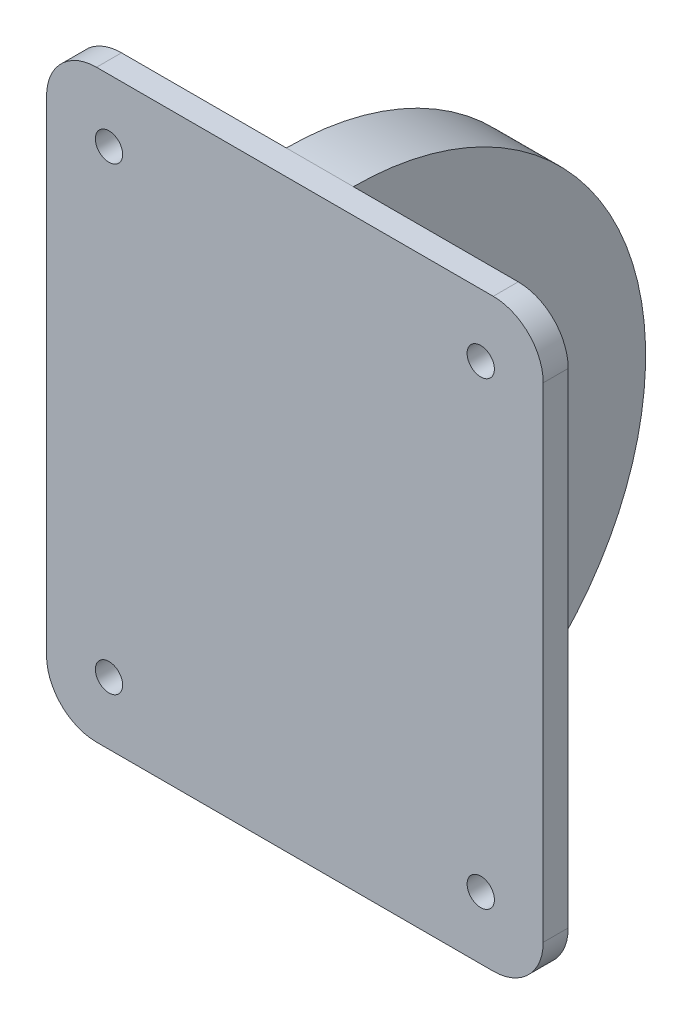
ISO-10303-21;
HEADER;
FILE_DESCRIPTION(('STEP AP214'),'2;1');
FILE_NAME('part.step','',(''),(''),'','','');
FILE_SCHEMA(('AUTOMOTIVE_DESIGN { 1 0 10303 214 1 1 1 1 }'));
ENDSEC;
DATA;
#1=APPLICATION_CONTEXT('core data for automotive mechanical design processes');
#2=APPLICATION_PROTOCOL_DEFINITION('international standard','automotive_design',2000,#1);
#3=PRODUCT_CONTEXT('',#1,'mechanical');
#4=PRODUCT('Part','Part','',(#3));
#5=PRODUCT_RELATED_PRODUCT_CATEGORY('part','',(#4));
#6=PRODUCT_DEFINITION_FORMATION('','',#4);
#7=PRODUCT_DEFINITION_CONTEXT('part definition',#1,'design');
#8=PRODUCT_DEFINITION('design','',#6,#7);
#9=PRODUCT_DEFINITION_SHAPE('','',#8);
#10=(LENGTH_UNIT() NAMED_UNIT(*) SI_UNIT(.MILLI.,.METRE.));
#11=(NAMED_UNIT(*) PLANE_ANGLE_UNIT() SI_UNIT($,.RADIAN.));
#12=(NAMED_UNIT(*) SI_UNIT($,.STERADIAN.) SOLID_ANGLE_UNIT());
#13=UNCERTAINTY_MEASURE_WITH_UNIT(LENGTH_MEASURE(1.E-05),#10,'distance_accuracy_value','');
#14=(GEOMETRIC_REPRESENTATION_CONTEXT(3) GLOBAL_UNCERTAINTY_ASSIGNED_CONTEXT((#13)) GLOBAL_UNIT_ASSIGNED_CONTEXT((#10,
#11,#12)) REPRESENTATION_CONTEXT('',''));
#15=CARTESIAN_POINT('',(0.,0.,0.));
#16=DIRECTION('',(0.,0.,1.));
#17=DIRECTION('',(1.,0.,0.));
#18=AXIS2_PLACEMENT_3D('',#15,#16,#17);
#19=CARTESIAN_POINT('',(0.,0.,0.));
#20=DIRECTION('',(0.,0.,1.));
#21=DIRECTION('',(1.,0.,0.));
#22=AXIS2_PLACEMENT_3D('',#19,#20,#21);
#23=PLANE('',#22);
#24=CARTESIAN_POINT('',(-14.8758680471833,18.3896666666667,0.));
#25=DIRECTION('',(0.,0.,1.));
#26=DIRECTION('',(1.,0.,0.));
#27=AXIS2_PLACEMENT_3D('',#24,#25,#26);
#28=CIRCLE('',#27,1.0922);
#29=CARTESIAN_POINT('',(-13.7836680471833,18.3896666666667,0.));
#30=VERTEX_POINT('',#29);
#31=EDGE_CURVE('E174',#30,#30,#28,.T.);
#32=ORIENTED_EDGE('',*,*,#31,.T.);
#33=EDGE_LOOP('',(#32));
#34=FACE_BOUND('',#33,.T.);
#35=CARTESIAN_POINT('',(-14.8758680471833,-18.3896666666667,0.));
#36=DIRECTION('',(0.,0.,1.));
#37=DIRECTION('',(1.,0.,0.));
#38=AXIS2_PLACEMENT_3D('',#35,#36,#37);
#39=CIRCLE('',#38,1.0922);
#40=CARTESIAN_POINT('',(-13.7836680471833,-18.3896666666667,0.));
#41=VERTEX_POINT('',#40);
#42=EDGE_CURVE('E159',#41,#41,#39,.T.);
#43=ORIENTED_EDGE('',*,*,#42,.T.);
#44=EDGE_LOOP('',(#43));
#45=FACE_BOUND('',#44,.T.);
#46=DIRECTION('',(0.,-1.,0.));
#47=VECTOR('',#46,1.);
#48=CARTESIAN_POINT('',(-2.68333333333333,23.3896666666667,0.));
#49=LINE('',#48,#47);
#50=CARTESIAN_POINT('',(-2.68333333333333,23.3896666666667,0.));
#51=VERTEX_POINT('',#50);
#52=CARTESIAN_POINT('',(-2.68333333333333,-23.3896666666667,0.));
#53=VERTEX_POINT('',#52);
#54=EDGE_CURVE('E132',#51,#53,#49,.T.);
#55=ORIENTED_EDGE('',*,*,#54,.T.);
#56=DIRECTION('',(1.,0.,0.));
#57=VECTOR('',#56,1.);
#58=CARTESIAN_POINT('',(-19.8758680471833,-23.3896666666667,0.));
#59=LINE('',#58,#57);
#60=CARTESIAN_POINT('',(-15.8758680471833,-23.3896666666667,0.));
#61=VERTEX_POINT('',#60);
#62=EDGE_CURVE('E183',#61,#53,#59,.T.);
#63=ORIENTED_EDGE('',*,*,#62,.F.);
#64=CARTESIAN_POINT('',(-15.8758680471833,-19.3896666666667,0.));
#65=DIRECTION('',(0.,0.,1.));
#66=DIRECTION('',(1.,0.,0.));
#67=AXIS2_PLACEMENT_3D('',#64,#65,#66);
#68=CIRCLE('',#67,4.);
#69=CARTESIAN_POINT('',(-19.8758680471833,-19.3896666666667,0.));
#70=VERTEX_POINT('',#69);
#71=EDGE_CURVE('E208',#61,#70,#68,.F.);
#72=ORIENTED_EDGE('',*,*,#71,.T.);
#73=DIRECTION('',(0.,-1.,0.));
#74=VECTOR('',#73,1.);
#75=CARTESIAN_POINT('',(-19.8758680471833,23.3896666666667,0.));
#76=LINE('',#75,#74);
#77=CARTESIAN_POINT('',(-19.8758680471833,19.3896666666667,0.));
#78=VERTEX_POINT('',#77);
#79=EDGE_CURVE('E195',#78,#70,#76,.T.);
#80=ORIENTED_EDGE('',*,*,#79,.F.);
#81=CARTESIAN_POINT('',(-15.8758680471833,19.3896666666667,0.));
#82=DIRECTION('',(0.,0.,1.));
#83=DIRECTION('',(1.,0.,0.));
#84=AXIS2_PLACEMENT_3D('',#81,#82,#83);
#85=CIRCLE('',#84,4.);
#86=CARTESIAN_POINT('',(-15.8758680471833,23.3896666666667,0.));
#87=VERTEX_POINT('',#86);
#88=EDGE_CURVE('E135',#78,#87,#85,.F.);
#89=ORIENTED_EDGE('',*,*,#88,.T.);
#90=DIRECTION('',(-1.,0.,0.));
#91=VECTOR('',#90,1.);
#92=CARTESIAN_POINT('',(-19.8758680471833,23.3896666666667,0.));
#93=LINE('',#92,#91);
#94=EDGE_CURVE('E118',#51,#87,#93,.T.);
#95=ORIENTED_EDGE('',*,*,#94,.F.);
#96=EDGE_LOOP('',(#55,#63,#72,#80,#89,#95));
#97=FACE_BOUND('',#96,.T.);
#98=ADVANCED_FACE('F40',(#34,#45,#97),#23,.F.);
#99=CARTESIAN_POINT('',(19.8758680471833,23.3896666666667,2.));
#100=DIRECTION('',(-1.,0.,0.));
#101=DIRECTION('',(0.,-1.,0.));
#102=AXIS2_PLACEMENT_3D('',#99,#100,#101);
#103=PLANE('',#102);
#104=DIRECTION('',(0.,1.,0.));
#105=VECTOR('',#104,1.);
#106=CARTESIAN_POINT('',(19.8758680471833,23.3896666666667,2.));
#107=LINE('',#106,#105);
#108=CARTESIAN_POINT('',(19.8758680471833,-19.3896666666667,2.));
#109=VERTEX_POINT('',#108);
#110=CARTESIAN_POINT('',(19.8758680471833,19.3896666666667,2.));
#111=VERTEX_POINT('',#110);
#112=EDGE_CURVE('E179',#109,#111,#107,.T.);
#113=ORIENTED_EDGE('',*,*,#112,.F.);
#114=DIRECTION('',(0.,0.,-1.));
#115=VECTOR('',#114,1.);
#116=CARTESIAN_POINT('',(19.8758680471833,-19.3896666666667,2.));
#117=LINE('',#116,#115);
#118=CARTESIAN_POINT('',(19.8758680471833,-19.3896666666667,0.));
#119=VERTEX_POINT('',#118);
#120=EDGE_CURVE('E225',#109,#119,#117,.T.);
#121=ORIENTED_EDGE('',*,*,#120,.T.);
#122=DIRECTION('',(0.,1.,0.));
#123=VECTOR('',#122,1.);
#124=CARTESIAN_POINT('',(19.8758680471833,23.3896666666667,0.));
#125=LINE('',#124,#123);
#126=CARTESIAN_POINT('',(19.8758680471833,19.3896666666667,0.));
#127=VERTEX_POINT('',#126);
#128=EDGE_CURVE('E137',#119,#127,#125,.T.);
#129=ORIENTED_EDGE('',*,*,#128,.T.);
#130=DIRECTION('',(0.,0.,-1.));
#131=VECTOR('',#130,1.);
#132=CARTESIAN_POINT('',(19.8758680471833,19.3896666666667,2.));
#133=LINE('',#132,#131);
#134=EDGE_CURVE('E223',#127,#111,#133,.F.);
#135=ORIENTED_EDGE('',*,*,#134,.T.);
#136=EDGE_LOOP('',(#113,#121,#129,#135));
#137=FACE_BOUND('',#136,.T.);
#138=ADVANCED_FACE('F236',(#137),#103,.F.);
#139=CARTESIAN_POINT('',(-19.8758680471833,23.3896666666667,2.));
#140=DIRECTION('',(0.,-1.,0.));
#141=DIRECTION('',(0.,0.,-1.));
#142=AXIS2_PLACEMENT_3D('',#139,#140,#141);
#143=PLANE('',#142);
#144=CARTESIAN_POINT('',(15.8758680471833,23.3896666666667,0.));
#145=VERTEX_POINT('',#144);
#146=CARTESIAN_POINT('',(2.68333333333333,23.3896666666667,0.));
#147=VERTEX_POINT('',#146);
#148=EDGE_CURVE('E121',#145,#147,#93,.T.);
#149=ORIENTED_EDGE('',*,*,#148,.T.);
#150=DIRECTION('',(-1.,0.,0.));
#151=VECTOR('',#150,1.);
#152=CARTESIAN_POINT('',(2.68333333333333,23.3896666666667,0.));
#153=LINE('',#152,#151);
#154=EDGE_CURVE('E115',#147,#51,#153,.T.);
#155=ORIENTED_EDGE('',*,*,#154,.T.);
#156=ORIENTED_EDGE('',*,*,#94,.T.);
#157=DIRECTION('',(0.,0.,-1.));
#158=VECTOR('',#157,1.);
#159=CARTESIAN_POINT('',(-15.8758680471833,23.3896666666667,2.));
#160=LINE('',#159,#158);
#161=CARTESIAN_POINT('',(-15.8758680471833,23.3896666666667,2.));
#162=VERTEX_POINT('',#161);
#163=EDGE_CURVE('E11',#87,#162,#160,.F.);
#164=ORIENTED_EDGE('',*,*,#163,.T.);
#165=DIRECTION('',(-1.,0.,0.));
#166=VECTOR('',#165,1.);
#167=CARTESIAN_POINT('',(-19.8758680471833,23.3896666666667,2.));
#168=LINE('',#167,#166);
#169=CARTESIAN_POINT('',(15.8758680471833,23.3896666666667,2.));
#170=VERTEX_POINT('',#169);
#171=EDGE_CURVE('E182',#170,#162,#168,.T.);
#172=ORIENTED_EDGE('',*,*,#171,.F.);
#173=DIRECTION('',(0.,0.,-1.));
#174=VECTOR('',#173,1.);
#175=CARTESIAN_POINT('',(15.8758680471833,23.3896666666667,2.));
#176=LINE('',#175,#174);
#177=EDGE_CURVE('E48',#170,#145,#176,.T.);
#178=ORIENTED_EDGE('',*,*,#177,.T.);
#179=EDGE_LOOP('',(#149,#155,#156,#164,#172,#178));
#180=FACE_BOUND('',#179,.T.);
#181=ADVANCED_FACE('F117',(#180),#143,.F.);
#182=CARTESIAN_POINT('',(-19.8758680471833,23.3896666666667,2.));
#183=DIRECTION('',(1.,0.,0.));
#184=DIRECTION('',(0.,1.,0.));
#185=AXIS2_PLACEMENT_3D('',#182,#183,#184);
#186=PLANE('',#185);
#187=ORIENTED_EDGE('',*,*,#79,.T.);
#188=DIRECTION('',(0.,0.,-1.));
#189=VECTOR('',#188,1.);
#190=CARTESIAN_POINT('',(-19.8758680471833,-19.3896666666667,2.));
#191=LINE('',#190,#189);
#192=CARTESIAN_POINT('',(-19.8758680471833,-19.3896666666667,2.));
#193=VERTEX_POINT('',#192);
#194=EDGE_CURVE('E213',#70,#193,#191,.F.);
#195=ORIENTED_EDGE('',*,*,#194,.T.);
#196=DIRECTION('',(0.,-1.,0.));
#197=VECTOR('',#196,1.);
#198=CARTESIAN_POINT('',(-19.8758680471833,23.3896666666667,2.));
#199=LINE('',#198,#197);
#200=CARTESIAN_POINT('',(-19.8758680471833,19.3896666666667,2.));
#201=VERTEX_POINT('',#200);
#202=EDGE_CURVE('E186',#201,#193,#199,.T.);
#203=ORIENTED_EDGE('',*,*,#202,.F.);
#204=DIRECTION('',(0.,0.,-1.));
#205=VECTOR('',#204,1.);
#206=CARTESIAN_POINT('',(-19.8758680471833,19.3896666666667,2.));
#207=LINE('',#206,#205);
#208=EDGE_CURVE('E210',#201,#78,#207,.T.);
#209=ORIENTED_EDGE('',*,*,#208,.T.);
#210=EDGE_LOOP('',(#187,#195,#203,#209));
#211=FACE_BOUND('',#210,.T.);
#212=ADVANCED_FACE('F255',(#211),#186,.F.);
#213=CARTESIAN_POINT('',(-19.8758680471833,-23.3896666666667,2.));
#214=DIRECTION('',(0.,1.,0.));
#215=DIRECTION('',(0.,0.,1.));
#216=AXIS2_PLACEMENT_3D('',#213,#214,#215);
#217=PLANE('',#216);
#218=DIRECTION('',(1.,0.,0.));
#219=VECTOR('',#218,1.);
#220=CARTESIAN_POINT('',(-19.8758680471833,-23.3896666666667,2.));
#221=LINE('',#220,#219);
#222=CARTESIAN_POINT('',(-15.8758680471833,-23.3896666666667,2.));
#223=VERTEX_POINT('',#222);
#224=CARTESIAN_POINT('',(15.8758680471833,-23.3896666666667,2.));
#225=VERTEX_POINT('',#224);
#226=EDGE_CURVE('E189',#223,#225,#221,.T.);
#227=ORIENTED_EDGE('',*,*,#226,.F.);
#228=DIRECTION('',(0.,0.,-1.));
#229=VECTOR('',#228,1.);
#230=CARTESIAN_POINT('',(-15.8758680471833,-23.3896666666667,2.));
#231=LINE('',#230,#229);
#232=EDGE_CURVE('E200',#223,#61,#231,.T.);
#233=ORIENTED_EDGE('',*,*,#232,.T.);
#234=ORIENTED_EDGE('',*,*,#62,.T.);
#235=DIRECTION('',(-1.,0.,0.));
#236=VECTOR('',#235,1.);
#237=CARTESIAN_POINT('',(2.68333333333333,-23.3896666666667,0.));
#238=LINE('',#237,#236);
#239=CARTESIAN_POINT('',(2.68333333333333,-23.3896666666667,0.));
#240=VERTEX_POINT('',#239);
#241=EDGE_CURVE('E127',#240,#53,#238,.T.);
#242=ORIENTED_EDGE('',*,*,#241,.F.);
#243=CARTESIAN_POINT('',(15.8758680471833,-23.3896666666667,0.));
#244=VERTEX_POINT('',#243);
#245=EDGE_CURVE('E60',#240,#244,#59,.T.);
#246=ORIENTED_EDGE('',*,*,#245,.T.);
#247=DIRECTION('',(0.,0.,-1.));
#248=VECTOR('',#247,1.);
#249=CARTESIAN_POINT('',(15.8758680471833,-23.3896666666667,2.));
#250=LINE('',#249,#248);
#251=EDGE_CURVE('E192',#244,#225,#250,.F.);
#252=ORIENTED_EDGE('',*,*,#251,.T.);
#253=EDGE_LOOP('',(#227,#233,#234,#242,#246,#252));
#254=FACE_BOUND('',#253,.T.);
#255=ADVANCED_FACE('F247',(#254),#217,.F.);
#256=CARTESIAN_POINT('',(0.,0.,2.));
#257=DIRECTION('',(0.,0.,1.));
#258=DIRECTION('',(1.,0.,0.));
#259=AXIS2_PLACEMENT_3D('',#256,#257,#258);
#260=PLANE('',#259);
#261=CARTESIAN_POINT('',(14.8758680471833,18.3896666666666,2.));
#262=DIRECTION('',(0.,0.,1.));
#263=DIRECTION('',(1.,0.,0.));
#264=AXIS2_PLACEMENT_3D('',#261,#262,#263);
#265=CIRCLE('',#264,1.0922);
#266=CARTESIAN_POINT('',(15.9680680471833,18.3896666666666,2.));
#267=VERTEX_POINT('',#266);
#268=EDGE_CURVE('E162',#267,#267,#265,.T.);
#269=ORIENTED_EDGE('',*,*,#268,.F.);
#270=EDGE_LOOP('',(#269));
#271=FACE_BOUND('',#270,.T.);
#272=CARTESIAN_POINT('',(-14.8758680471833,-18.3896666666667,2.));
#273=DIRECTION('',(0.,0.,1.));
#274=DIRECTION('',(1.,0.,0.));
#275=AXIS2_PLACEMENT_3D('',#272,#273,#274);
#276=CIRCLE('',#275,1.0922);
#277=CARTESIAN_POINT('',(-13.7836680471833,-18.3896666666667,2.));
#278=VERTEX_POINT('',#277);
#279=EDGE_CURVE('E169',#278,#278,#276,.T.);
#280=ORIENTED_EDGE('',*,*,#279,.F.);
#281=EDGE_LOOP('',(#280));
#282=FACE_BOUND('',#281,.T.);
#283=CARTESIAN_POINT('',(14.8758680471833,-18.3896666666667,2.));
#284=DIRECTION('',(0.,0.,1.));
#285=DIRECTION('',(1.,0.,0.));
#286=AXIS2_PLACEMENT_3D('',#283,#284,#285);
#287=CIRCLE('',#286,1.0922);
#288=CARTESIAN_POINT('',(15.9680680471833,-18.3896666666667,2.));
#289=VERTEX_POINT('',#288);
#290=EDGE_CURVE('E156',#289,#289,#287,.T.);
#291=ORIENTED_EDGE('',*,*,#290,.F.);
#292=EDGE_LOOP('',(#291));
#293=FACE_BOUND('',#292,.T.);
#294=CARTESIAN_POINT('',(-14.8758680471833,18.3896666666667,2.));
#295=DIRECTION('',(0.,0.,1.));
#296=DIRECTION('',(1.,0.,0.));
#297=AXIS2_PLACEMENT_3D('',#294,#295,#296);
#298=CIRCLE('',#297,1.0922);
#299=CARTESIAN_POINT('',(-13.7836680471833,18.3896666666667,2.));
#300=VERTEX_POINT('',#299);
#301=EDGE_CURVE('E165',#300,#300,#298,.T.);
#302=ORIENTED_EDGE('',*,*,#301,.F.);
#303=EDGE_LOOP('',(#302));
#304=FACE_BOUND('',#303,.T.);
#305=ORIENTED_EDGE('',*,*,#202,.T.);
#306=CARTESIAN_POINT('',(-15.8758680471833,-19.3896666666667,2.));
#307=DIRECTION('',(0.,0.,1.));
#308=DIRECTION('',(1.,0.,0.));
#309=AXIS2_PLACEMENT_3D('',#306,#307,#308);
#310=CIRCLE('',#309,4.);
#311=EDGE_CURVE('E221',#193,#223,#310,.T.);
#312=ORIENTED_EDGE('',*,*,#311,.T.);
#313=ORIENTED_EDGE('',*,*,#226,.T.);
#314=CARTESIAN_POINT('',(15.8758680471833,-19.3896666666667,2.));
#315=DIRECTION('',(0.,0.,1.));
#316=DIRECTION('',(1.,0.,0.));
#317=AXIS2_PLACEMENT_3D('',#314,#315,#316);
#318=CIRCLE('',#317,4.);
#319=EDGE_CURVE('E219',#225,#109,#318,.T.);
#320=ORIENTED_EDGE('',*,*,#319,.T.);
#321=ORIENTED_EDGE('',*,*,#112,.T.);
#322=CARTESIAN_POINT('',(15.8758680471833,19.3896666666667,2.));
#323=DIRECTION('',(0.,0.,1.));
#324=DIRECTION('',(1.,0.,0.));
#325=AXIS2_PLACEMENT_3D('',#322,#323,#324);
#326=CIRCLE('',#325,4.);
#327=EDGE_CURVE('E215',#111,#170,#326,.T.);
#328=ORIENTED_EDGE('',*,*,#327,.T.);
#329=ORIENTED_EDGE('',*,*,#171,.T.);
#330=CARTESIAN_POINT('',(-15.8758680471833,19.3896666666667,2.));
#331=DIRECTION('',(0.,0.,1.));
#332=DIRECTION('',(1.,0.,0.));
#333=AXIS2_PLACEMENT_3D('',#330,#331,#332);
#334=CIRCLE('',#333,4.);
#335=EDGE_CURVE('E217',#162,#201,#334,.T.);
#336=ORIENTED_EDGE('',*,*,#335,.T.);
#337=EDGE_LOOP('',(#305,#312,#313,#320,#321,#328,#329,#336));
#338=FACE_BOUND('',#337,.T.);
#339=ADVANCED_FACE('F239',(#271,#282,#293,#304,#338),#260,.T.);
#340=CARTESIAN_POINT('',(14.8758680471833,18.3896666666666,0.));
#341=DIRECTION('',(0.,0.,1.));
#342=DIRECTION('',(1.,0.,0.));
#343=AXIS2_PLACEMENT_3D('',#340,#341,#342);
#344=CIRCLE('',#343,1.0922);
#345=CARTESIAN_POINT('',(15.9680680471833,18.3896666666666,0.));
#346=VERTEX_POINT('',#345);
#347=EDGE_CURVE('E166',#346,#346,#344,.T.);
#348=ORIENTED_EDGE('',*,*,#347,.T.);
#349=EDGE_LOOP('',(#348));
#350=FACE_BOUND('',#349,.T.);
#351=CARTESIAN_POINT('',(14.8758680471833,-18.3896666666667,0.));
#352=DIRECTION('',(0.,0.,1.));
#353=DIRECTION('',(1.,0.,0.));
#354=AXIS2_PLACEMENT_3D('',#351,#352,#353);
#355=CIRCLE('',#354,1.0922);
#356=CARTESIAN_POINT('',(15.9680680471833,-18.3896666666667,0.));
#357=VERTEX_POINT('',#356);
#358=EDGE_CURVE('E126',#357,#357,#355,.T.);
#359=ORIENTED_EDGE('',*,*,#358,.T.);
#360=EDGE_LOOP('',(#359));
#361=FACE_BOUND('',#360,.T.);
#362=ORIENTED_EDGE('',*,*,#245,.F.);
#363=DIRECTION('',(0.,-1.,0.));
#364=VECTOR('',#363,1.);
#365=CARTESIAN_POINT('',(2.68333333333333,23.3896666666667,0.));
#366=LINE('',#365,#364);
#367=EDGE_CURVE('E55',#147,#240,#366,.T.);
#368=ORIENTED_EDGE('',*,*,#367,.F.);
#369=ORIENTED_EDGE('',*,*,#148,.F.);
#370=CARTESIAN_POINT('',(15.8758680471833,19.3896666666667,0.));
#371=DIRECTION('',(0.,0.,1.));
#372=DIRECTION('',(1.,0.,0.));
#373=AXIS2_PLACEMENT_3D('',#370,#371,#372);
#374=CIRCLE('',#373,4.);
#375=EDGE_CURVE('E203',#145,#127,#374,.F.);
#376=ORIENTED_EDGE('',*,*,#375,.T.);
#377=ORIENTED_EDGE('',*,*,#128,.F.);
#378=CARTESIAN_POINT('',(15.8758680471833,-19.3896666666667,0.));
#379=DIRECTION('',(0.,0.,1.));
#380=DIRECTION('',(1.,0.,0.));
#381=AXIS2_PLACEMENT_3D('',#378,#379,#380);
#382=CIRCLE('',#381,4.);
#383=EDGE_CURVE('E206',#119,#244,#382,.F.);
#384=ORIENTED_EDGE('',*,*,#383,.T.);
#385=EDGE_LOOP('',(#362,#368,#369,#376,#377,#384));
#386=FACE_BOUND('',#385,.T.);
#387=ADVANCED_FACE('F231',(#350,#361,#386),#23,.F.);
#388=CARTESIAN_POINT('',(-15.8758680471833,-19.3896666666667,2.));
#389=DIRECTION('',(0.,0.,-1.));
#390=DIRECTION('',(-1.,0.,0.));
#391=AXIS2_PLACEMENT_3D('',#388,#389,#390);
#392=CYLINDRICAL_SURFACE('',#391,4.);
#393=ORIENTED_EDGE('',*,*,#311,.F.);
#394=ORIENTED_EDGE('',*,*,#194,.F.);
#395=ORIENTED_EDGE('',*,*,#71,.F.);
#396=ORIENTED_EDGE('',*,*,#232,.F.);
#397=EDGE_LOOP('',(#393,#394,#395,#396));
#398=FACE_BOUND('',#397,.T.);
#399=ADVANCED_FACE('F253',(#398),#392,.T.);
#400=CARTESIAN_POINT('',(15.8758680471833,-19.3896666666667,2.));
#401=DIRECTION('',(0.,0.,-1.));
#402=DIRECTION('',(-1.,0.,0.));
#403=AXIS2_PLACEMENT_3D('',#400,#401,#402);
#404=CYLINDRICAL_SURFACE('',#403,4.);
#405=ORIENTED_EDGE('',*,*,#319,.F.);
#406=ORIENTED_EDGE('',*,*,#251,.F.);
#407=ORIENTED_EDGE('',*,*,#383,.F.);
#408=ORIENTED_EDGE('',*,*,#120,.F.);
#409=EDGE_LOOP('',(#405,#406,#407,#408));
#410=FACE_BOUND('',#409,.T.);
#411=ADVANCED_FACE('F243',(#410),#404,.T.);
#412=CARTESIAN_POINT('',(-15.8758680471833,19.3896666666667,2.));
#413=DIRECTION('',(0.,0.,-1.));
#414=DIRECTION('',(-1.,0.,0.));
#415=AXIS2_PLACEMENT_3D('',#412,#413,#414);
#416=CYLINDRICAL_SURFACE('',#415,4.);
#417=ORIENTED_EDGE('',*,*,#335,.F.);
#418=ORIENTED_EDGE('',*,*,#163,.F.);
#419=ORIENTED_EDGE('',*,*,#88,.F.);
#420=ORIENTED_EDGE('',*,*,#208,.F.);
#421=EDGE_LOOP('',(#417,#418,#419,#420));
#422=FACE_BOUND('',#421,.T.);
#423=ADVANCED_FACE('F258',(#422),#416,.T.);
#424=CARTESIAN_POINT('',(15.8758680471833,19.3896666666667,2.));
#425=DIRECTION('',(0.,0.,-1.));
#426=DIRECTION('',(-1.,0.,0.));
#427=AXIS2_PLACEMENT_3D('',#424,#425,#426);
#428=CYLINDRICAL_SURFACE('',#427,4.);
#429=ORIENTED_EDGE('',*,*,#327,.F.);
#430=ORIENTED_EDGE('',*,*,#134,.F.);
#431=ORIENTED_EDGE('',*,*,#375,.F.);
#432=ORIENTED_EDGE('',*,*,#177,.F.);
#433=EDGE_LOOP('',(#429,#430,#431,#432));
#434=FACE_BOUND('',#433,.T.);
#435=ADVANCED_FACE('F42',(#434),#428,.T.);
#436=CARTESIAN_POINT('',(-14.8758680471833,18.3896666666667,0.));
#437=DIRECTION('',(0.,0.,1.));
#438=DIRECTION('',(1.,0.,0.));
#439=AXIS2_PLACEMENT_3D('',#436,#437,#438);
#440=CYLINDRICAL_SURFACE('',#439,1.0922);
#441=ORIENTED_EDGE('',*,*,#31,.F.);
#442=EDGE_LOOP('',(#441));
#443=FACE_BOUND('',#442,.T.);
#444=ORIENTED_EDGE('',*,*,#301,.T.);
#445=EDGE_LOOP('',(#444));
#446=FACE_BOUND('',#445,.T.);
#447=ADVANCED_FACE('F264',(#443,#446),#440,.F.);
#448=CARTESIAN_POINT('',(14.8758680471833,-18.3896666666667,0.));
#449=DIRECTION('',(0.,0.,1.));
#450=DIRECTION('',(1.,0.,0.));
#451=AXIS2_PLACEMENT_3D('',#448,#449,#450);
#452=CYLINDRICAL_SURFACE('',#451,1.0922);
#453=ORIENTED_EDGE('',*,*,#358,.F.);
#454=EDGE_LOOP('',(#453));
#455=FACE_BOUND('',#454,.T.);
#456=ORIENTED_EDGE('',*,*,#290,.T.);
#457=EDGE_LOOP('',(#456));
#458=FACE_BOUND('',#457,.T.);
#459=ADVANCED_FACE('F288',(#455,#458),#452,.F.);
#460=CARTESIAN_POINT('',(-14.8758680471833,-18.3896666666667,0.));
#461=DIRECTION('',(0.,0.,1.));
#462=DIRECTION('',(1.,0.,0.));
#463=AXIS2_PLACEMENT_3D('',#460,#461,#462);
#464=CYLINDRICAL_SURFACE('',#463,1.0922);
#465=ORIENTED_EDGE('',*,*,#42,.F.);
#466=EDGE_LOOP('',(#465));
#467=FACE_BOUND('',#466,.T.);
#468=ORIENTED_EDGE('',*,*,#279,.T.);
#469=EDGE_LOOP('',(#468));
#470=FACE_BOUND('',#469,.T.);
#471=ADVANCED_FACE('F291',(#467,#470),#464,.F.);
#472=CARTESIAN_POINT('',(14.8758680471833,18.3896666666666,0.));
#473=DIRECTION('',(0.,0.,1.));
#474=DIRECTION('',(1.,0.,0.));
#475=AXIS2_PLACEMENT_3D('',#472,#473,#474);
#476=CYLINDRICAL_SURFACE('',#475,1.0922);
#477=ORIENTED_EDGE('',*,*,#347,.F.);
#478=EDGE_LOOP('',(#477));
#479=FACE_BOUND('',#478,.T.);
#480=ORIENTED_EDGE('',*,*,#268,.T.);
#481=EDGE_LOOP('',(#480));
#482=FACE_BOUND('',#481,.T.);
#483=ADVANCED_FACE('F307',(#479,#482),#476,.F.);
#484=CARTESIAN_POINT('',(2.68333333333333,0.,0.));
#485=DIRECTION('',(-1.,0.,0.));
#486=DIRECTION('',(0.,0.,1.));
#487=AXIS2_PLACEMENT_3D('',#484,#485,#486);
#488=CYLINDRICAL_SURFACE('',#487,23.3896666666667);
#489=CARTESIAN_POINT('',(-2.68333333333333,0.,0.));
#490=DIRECTION('',(1.,0.,0.));
#491=DIRECTION('',(0.,0.,-1.));
#492=AXIS2_PLACEMENT_3D('',#489,#490,#491);
#493=CIRCLE('',#492,23.3896666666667);
#494=EDGE_CURVE('E142',#53,#51,#493,.T.);
#495=ORIENTED_EDGE('',*,*,#494,.T.);
#496=ORIENTED_EDGE('',*,*,#154,.F.);
#497=CARTESIAN_POINT('',(2.68333333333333,0.,0.));
#498=DIRECTION('',(1.,0.,0.));
#499=DIRECTION('',(0.,0.,-1.));
#500=AXIS2_PLACEMENT_3D('',#497,#498,#499);
#501=CIRCLE('',#500,23.3896666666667);
#502=EDGE_CURVE('E143',#240,#147,#501,.T.);
#503=ORIENTED_EDGE('',*,*,#502,.F.);
#504=ORIENTED_EDGE('',*,*,#241,.T.);
#505=EDGE_LOOP('',(#495,#496,#503,#504));
#506=FACE_BOUND('',#505,.T.);
#507=ADVANCED_FACE('F146',(#506),#488,.T.);
#508=CARTESIAN_POINT('',(2.68333333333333,0.,0.));
#509=DIRECTION('',(1.,0.,0.));
#510=DIRECTION('',(0.,0.,-1.));
#511=AXIS2_PLACEMENT_3D('',#508,#509,#510);
#512=PLANE('',#511);
#513=CARTESIAN_POINT('',(2.68333333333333,0.,-10.61));
#514=DIRECTION('',(1.,0.,0.));
#515=DIRECTION('',(0.,0.,-1.));
#516=AXIS2_PLACEMENT_3D('',#513,#514,#515);
#517=CIRCLE('',#516,5.);
#518=CARTESIAN_POINT('',(2.68333333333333,0.,-15.61));
#519=VERTEX_POINT('',#518);
#520=EDGE_CURVE('E150',#519,#519,#517,.T.);
#521=ORIENTED_EDGE('',*,*,#520,.F.);
#522=EDGE_LOOP('',(#521));
#523=FACE_BOUND('',#522,.T.);
#524=ORIENTED_EDGE('',*,*,#502,.T.);
#525=ORIENTED_EDGE('',*,*,#367,.T.);
#526=EDGE_LOOP('',(#524,#525));
#527=FACE_BOUND('',#526,.T.);
#528=ADVANCED_FACE('F314',(#523,#527),#512,.T.);
#529=CARTESIAN_POINT('',(-2.68333333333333,0.,0.));
#530=DIRECTION('',(1.,0.,0.));
#531=DIRECTION('',(0.,0.,-1.));
#532=AXIS2_PLACEMENT_3D('',#529,#530,#531);
#533=PLANE('',#532);
#534=CARTESIAN_POINT('',(-2.68333333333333,0.,-10.61));
#535=DIRECTION('',(1.,0.,0.));
#536=DIRECTION('',(0.,0.,-1.));
#537=AXIS2_PLACEMENT_3D('',#534,#535,#536);
#538=CIRCLE('',#537,5.);
#539=CARTESIAN_POINT('',(-2.68333333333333,0.,-15.61));
#540=VERTEX_POINT('',#539);
#541=EDGE_CURVE('E147',#540,#540,#538,.F.);
#542=ORIENTED_EDGE('',*,*,#541,.F.);
#543=EDGE_LOOP('',(#542));
#544=FACE_BOUND('',#543,.T.);
#545=ORIENTED_EDGE('',*,*,#494,.F.);
#546=ORIENTED_EDGE('',*,*,#54,.F.);
#547=EDGE_LOOP('',(#545,#546));
#548=FACE_BOUND('',#547,.T.);
#549=ADVANCED_FACE('F141',(#544,#548),#533,.F.);
#550=CARTESIAN_POINT('',(-19.8768680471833,0.,-10.61));
#551=DIRECTION('',(1.,0.,0.));
#552=DIRECTION('',(0.,0.,-1.));
#553=AXIS2_PLACEMENT_3D('',#550,#551,#552);
#554=CYLINDRICAL_SURFACE('',#553,5.);
#555=CARTESIAN_POINT('',(2.68333333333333,0.,-15.61));
#556=CARTESIAN_POINT('',(2.62743055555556,0.,-15.61));
#557=CARTESIAN_POINT('',(2.57152777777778,0.,-15.61));
#558=CARTESIAN_POINT('',(2.45972222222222,0.,-15.61));
#559=CARTESIAN_POINT('',(2.40381944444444,0.,-15.61));
#560=CARTESIAN_POINT('',(2.29201388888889,0.,-15.61));
#561=CARTESIAN_POINT('',(2.23611111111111,0.,-15.61));
#562=CARTESIAN_POINT('',(2.12430555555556,0.,-15.61));
#563=CARTESIAN_POINT('',(2.06840277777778,0.,-15.61));
#564=CARTESIAN_POINT('',(1.95659722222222,0.,-15.61));
#565=CARTESIAN_POINT('',(1.90069444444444,0.,-15.61));
#566=CARTESIAN_POINT('',(1.78888888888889,0.,-15.61));
#567=CARTESIAN_POINT('',(1.73298611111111,0.,-15.61));
#568=CARTESIAN_POINT('',(1.62118055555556,0.,-15.61));
#569=CARTESIAN_POINT('',(1.56527777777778,0.,-15.61));
#570=CARTESIAN_POINT('',(1.45347222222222,0.,-15.61));
#571=CARTESIAN_POINT('',(1.39756944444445,0.,-15.61));
#572=CARTESIAN_POINT('',(1.28576388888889,0.,-15.61));
#573=CARTESIAN_POINT('',(1.22986111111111,0.,-15.61));
#574=CARTESIAN_POINT('',(1.11805555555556,0.,-15.61));
#575=CARTESIAN_POINT('',(1.06215277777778,0.,-15.61));
#576=CARTESIAN_POINT('',(0.950347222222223,0.,-15.61));
#577=CARTESIAN_POINT('',(0.894444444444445,0.,-15.61));
#578=CARTESIAN_POINT('',(0.782638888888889,0.,-15.61));
#579=CARTESIAN_POINT('',(0.726736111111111,0.,-15.61));
#580=CARTESIAN_POINT('',(0.614930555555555,0.,-15.61));
#581=CARTESIAN_POINT('',(0.559027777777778,0.,-15.61));
#582=CARTESIAN_POINT('',(0.447222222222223,0.,-15.61));
#583=CARTESIAN_POINT('',(0.391319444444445,0.,-15.61));
#584=CARTESIAN_POINT('',(0.279513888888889,0.,-15.61));
#585=CARTESIAN_POINT('',(0.223611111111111,0.,-15.61));
#586=CARTESIAN_POINT('',(0.111805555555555,0.,-15.61));
#587=CARTESIAN_POINT('',(0.0559027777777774,0.,-15.61));
#588=CARTESIAN_POINT('',(-0.0559027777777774,0.,-15.61));
#589=CARTESIAN_POINT('',(-0.111805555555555,0.,-15.61));
#590=CARTESIAN_POINT('',(-0.223611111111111,0.,-15.61));
#591=CARTESIAN_POINT('',(-0.279513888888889,0.,-15.61));
#592=CARTESIAN_POINT('',(-0.391319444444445,0.,-15.61));
#593=CARTESIAN_POINT('',(-0.447222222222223,0.,-15.61));
#594=CARTESIAN_POINT('',(-0.559027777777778,0.,-15.61));
#595=CARTESIAN_POINT('',(-0.614930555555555,0.,-15.61));
#596=CARTESIAN_POINT('',(-0.726736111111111,0.,-15.61));
#597=CARTESIAN_POINT('',(-0.782638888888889,0.,-15.61));
#598=CARTESIAN_POINT('',(-0.894444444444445,0.,-15.61));
#599=CARTESIAN_POINT('',(-0.950347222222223,0.,-15.61));
#600=CARTESIAN_POINT('',(-1.06215277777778,0.,-15.61));
#601=CARTESIAN_POINT('',(-1.11805555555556,0.,-15.61));
#602=CARTESIAN_POINT('',(-1.22986111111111,0.,-15.61));
#603=CARTESIAN_POINT('',(-1.28576388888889,0.,-15.61));
#604=CARTESIAN_POINT('',(-1.39756944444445,0.,-15.61));
#605=CARTESIAN_POINT('',(-1.45347222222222,0.,-15.61));
#606=CARTESIAN_POINT('',(-1.56527777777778,0.,-15.61));
#607=CARTESIAN_POINT('',(-1.62118055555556,0.,-15.61));
#608=CARTESIAN_POINT('',(-1.73298611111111,0.,-15.61));
#609=CARTESIAN_POINT('',(-1.78888888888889,0.,-15.61));
#610=CARTESIAN_POINT('',(-1.90069444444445,0.,-15.61));
#611=CARTESIAN_POINT('',(-1.95659722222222,0.,-15.61));
#612=CARTESIAN_POINT('',(-2.06840277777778,0.,-15.61));
#613=CARTESIAN_POINT('',(-2.12430555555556,0.,-15.61));
#614=CARTESIAN_POINT('',(-2.23611111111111,0.,-15.61));
#615=CARTESIAN_POINT('',(-2.29201388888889,0.,-15.61));
#616=CARTESIAN_POINT('',(-2.40381944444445,0.,-15.61));
#617=CARTESIAN_POINT('',(-2.45972222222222,0.,-15.61));
#618=CARTESIAN_POINT('',(-2.57152777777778,0.,-15.61));
#619=CARTESIAN_POINT('',(-2.62743055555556,0.,-15.61));
#620=CARTESIAN_POINT('',(-2.68333333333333,0.,-15.61));
#621=B_SPLINE_CURVE_WITH_KNOTS('',3,(#555,#556,#557,#558,#559,#560,#561,#562,#563,#564,#565,
#566,#567,#568,#569,#570,#571,#572,#573,#574,#575,#576,#577,#578,#579,#580,#581,#582,#583,#584,
#585,#586,#587,#588,#589,#590,#591,#592,#593,#594,#595,#596,#597,#598,#599,#600,#601,#602,#603,
#604,#605,#606,#607,#608,#609,#610,#611,#612,#613,#614,#615,#616,#617,#618,#619,#620),
.UNSPECIFIED.,.F.,.F.,(4,2,2,2,2,2,2,2,2,2,2,2,2,2,2,2,2,2,2,2,2,2,2,2,2,2,2,2,2,2,2,2,4),(0.,
0.167708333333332,0.335416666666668,0.503125,0.670833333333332,0.838541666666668,1.00625,
1.17395833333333,1.34166666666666,1.509375,1.67708333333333,1.84479166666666,2.0125,
2.18020833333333,2.34791666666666,2.515625,2.68333333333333,2.85104166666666,3.01875,
3.18645833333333,3.35416666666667,3.521875,3.68958333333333,3.85729166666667,4.025,
4.19270833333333,4.36041666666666,4.528125,4.69583333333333,4.86354166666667,5.03125,
5.19895833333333,5.36666666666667),.UNSPECIFIED.);
#622=EDGE_CURVE('BSEAM317',#519,#540,#621,.T.);
#623=ORIENTED_EDGE('',*,*,#520,.T.);
#624=ORIENTED_EDGE('',*,*,#541,.T.);
#625=ORIENTED_EDGE('',*,*,#622,.T.);
#626=ORIENTED_EDGE('',*,*,#622,.F.);
#627=EDGE_LOOP('',(#623,#625,#624,#626));
#628=FACE_BOUND('',#627,.T.);
#629=ADVANCED_FACE('F317',(#628),#554,.F.);
#630=CLOSED_SHELL('',(#98,#138,#181,#212,#255,#339,#387,#399,#411,#423,#435,#447,#459,#471,#483,
#507,#528,#549,#629));
#631=MANIFOLD_SOLID_BREP('B2',#630);
#632=ADVANCED_BREP_SHAPE_REPRESENTATION('',(#18,#631),#14);
#633=SHAPE_DEFINITION_REPRESENTATION(#9,#632);
ENDSEC;
END-ISO-10303-21;
